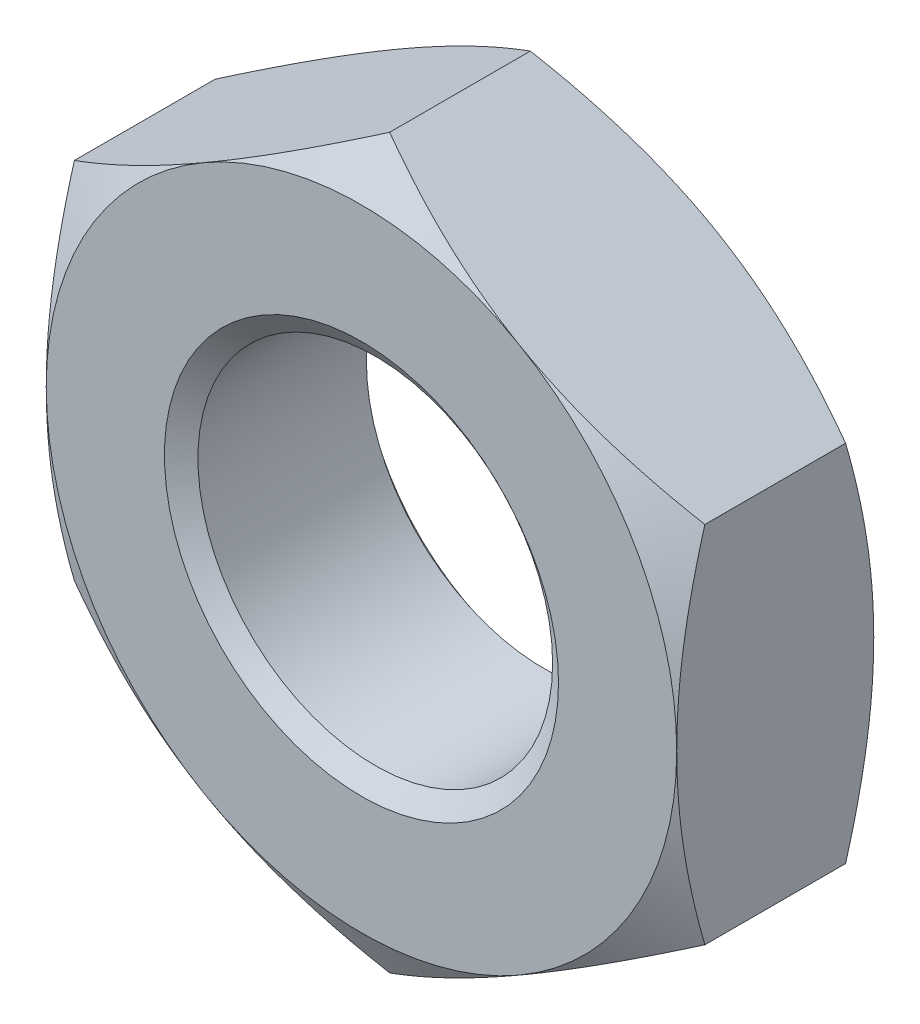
ISO-10303-21;
HEADER;
FILE_DESCRIPTION(('STEP AP214'),'2;1');
FILE_NAME('part.step','',(''),(''),'','','');
FILE_SCHEMA(('AUTOMOTIVE_DESIGN { 1 0 10303 214 1 1 1 1 }'));
ENDSEC;
DATA;
#1=APPLICATION_CONTEXT('core data for automotive mechanical design processes');
#2=APPLICATION_PROTOCOL_DEFINITION('international standard','automotive_design',2000,#1);
#3=PRODUCT_CONTEXT('',#1,'mechanical');
#4=PRODUCT('Part','Part','',(#3));
#5=PRODUCT_RELATED_PRODUCT_CATEGORY('part','',(#4));
#6=PRODUCT_DEFINITION_FORMATION('','',#4);
#7=PRODUCT_DEFINITION_CONTEXT('part definition',#1,'design');
#8=PRODUCT_DEFINITION('design','',#6,#7);
#9=PRODUCT_DEFINITION_SHAPE('','',#8);
#10=(LENGTH_UNIT() NAMED_UNIT(*) SI_UNIT(.MILLI.,.METRE.));
#11=(NAMED_UNIT(*) PLANE_ANGLE_UNIT() SI_UNIT($,.RADIAN.));
#12=(NAMED_UNIT(*) SI_UNIT($,.STERADIAN.) SOLID_ANGLE_UNIT());
#13=UNCERTAINTY_MEASURE_WITH_UNIT(LENGTH_MEASURE(1.E-05),#10,'distance_accuracy_value','');
#14=(GEOMETRIC_REPRESENTATION_CONTEXT(3) GLOBAL_UNCERTAINTY_ASSIGNED_CONTEXT((#13)) GLOBAL_UNIT_ASSIGNED_CONTEXT((#10,
#11,#12)) REPRESENTATION_CONTEXT('',''));
#15=CARTESIAN_POINT('',(0.,0.,0.));
#16=DIRECTION('',(0.,0.,1.));
#17=DIRECTION('',(1.,0.,0.));
#18=AXIS2_PLACEMENT_3D('',#15,#16,#17);
#19=CARTESIAN_POINT('',(0.,0.,-5.));
#20=DIRECTION('',(0.,0.,1.));
#21=DIRECTION('',(1.,0.,0.));
#22=AXIS2_PLACEMENT_3D('',#19,#20,#21);
#23=CYLINDRICAL_SURFACE('',#22,4.5);
#24=CARTESIAN_POINT('',(0.,0.,-0.350103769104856));
#25=DIRECTION('',(0.,0.,1.));
#26=DIRECTION('',(1.,0.,0.));
#27=AXIS2_PLACEMENT_3D('',#24,#25,#26);
#28=CIRCLE('',#27,4.5);
#29=CARTESIAN_POINT('',(4.5,0.,-0.350103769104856));
#30=VERTEX_POINT('',#29);
#31=EDGE_CURVE('E176',#30,#30,#28,.F.);
#32=ORIENTED_EDGE('',*,*,#31,.F.);
#33=EDGE_LOOP('',(#32));
#34=FACE_BOUND('',#33,.T.);
#35=CARTESIAN_POINT('',(0.,0.,-4.62449623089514));
#36=DIRECTION('',(0.,0.,-1.));
#37=DIRECTION('',(-1.,0.,0.));
#38=AXIS2_PLACEMENT_3D('',#35,#36,#37);
#39=CIRCLE('',#38,4.5);
#40=CARTESIAN_POINT('',(-4.5,0.,-4.62449623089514));
#41=VERTEX_POINT('',#40);
#42=EDGE_CURVE('E41',#41,#41,#39,.F.);
#43=ORIENTED_EDGE('',*,*,#42,.F.);
#44=EDGE_LOOP('',(#43));
#45=FACE_BOUND('',#44,.T.);
#46=ADVANCED_FACE('F36',(#34,#45),#23,.F.);
#47=CARTESIAN_POINT('',(0.,9.23760430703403,-5.));
#48=DIRECTION('',(-0.500000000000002,0.866025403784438,0.));
#49=DIRECTION('',(-0.866025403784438,-0.500000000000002,0.));
#50=AXIS2_PLACEMENT_3D('',#47,#48,#49);
#51=PLANE('',#50);
#52=DIRECTION('',(0.,0.,1.));
#53=VECTOR('',#52,1.);
#54=CARTESIAN_POINT('',(-8.,4.618802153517,-5.));
#55=LINE('',#54,#53);
#56=CARTESIAN_POINT('',(-8.,4.61880215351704,-4.28546882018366));
#57=VERTEX_POINT('',#56);
#58=CARTESIAN_POINT('',(-8.,4.618802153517,-0.714531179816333));
#59=VERTEX_POINT('',#58);
#60=EDGE_CURVE('E166',#57,#59,#55,.T.);
#61=ORIENTED_EDGE('',*,*,#60,.T.);
#62=CARTESIAN_POINT('',(-8.0002,4.61868668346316,-0.714597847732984));
#63=CARTESIAN_POINT('',(-7.8243512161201,4.72021302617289,-0.655990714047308));
#64=CARTESIAN_POINT('',(-7.64784680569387,4.82211789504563,-0.600043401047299));
#65=CARTESIAN_POINT('',(-7.29340453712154,5.02675523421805,-0.494201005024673));
#66=CARTESIAN_POINT('',(-7.11546609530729,5.12948804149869,-0.444308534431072));
#67=CARTESIAN_POINT('',(-6.57880176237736,5.43933133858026,-0.304692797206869));
#68=CARTESIAN_POINT('',(-6.21795741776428,5.64766491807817,-0.225281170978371));
#69=CARTESIAN_POINT('',(-5.67796082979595,5.95943209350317,-0.132161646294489));
#70=CARTESIAN_POINT('',(-5.50042181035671,6.06193429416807,-0.105634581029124));
#71=CARTESIAN_POINT('',(-5.1445408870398,6.26740224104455,-0.0611531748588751));
#72=CARTESIAN_POINT('',(-4.96619905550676,6.37036794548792,-0.0431980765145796));
#73=CARTESIAN_POINT('',(-4.6092083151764,6.57647664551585,-0.0163156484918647));
#74=CARTESIAN_POINT('',(-4.4305599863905,6.67961930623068,-0.00737807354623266));
#75=CARTESIAN_POINT('',(-4.07309829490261,6.88599991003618,0.00127769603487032));
#76=CARTESIAN_POINT('',(-3.89428493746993,6.98923785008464,0.00099617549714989));
#77=CARTESIAN_POINT('',(-3.55998663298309,7.18224506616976,-0.00814502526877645));
#78=CARTESIAN_POINT('',(-3.40447809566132,7.27202796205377,-0.0158896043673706));
#79=CARTESIAN_POINT('',(-3.09382523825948,7.45138347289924,-0.0382011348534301));
#80=CARTESIAN_POINT('',(-2.93868094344,7.54095607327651,-0.05276854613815));
#81=CARTESIAN_POINT('',(-2.47384868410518,7.80932710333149,-0.106360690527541));
#82=CARTESIAN_POINT('',(-2.16498351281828,7.98765049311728,-0.15526864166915));
#83=CARTESIAN_POINT('',(-1.5439767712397,8.34618890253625,-0.277539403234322));
#84=CARTESIAN_POINT('',(-1.23191445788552,8.52635816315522,-0.351420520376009));
#85=CARTESIAN_POINT('',(-0.612443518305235,8.88400987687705,-0.519100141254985));
#86=CARTESIAN_POINT('',(-0.305026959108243,9.06149691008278,-0.61285926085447));
#87=CARTESIAN_POINT('',(0.000200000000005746,9.23771977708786,-0.714597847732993));
#88=B_SPLINE_CURVE_WITH_KNOTS('',3,(#62,#63,#64,#65,#66,#67,#68,#69,#70,#71,#72,#73,#74,#75,#76,
#77,#78,#79,#80,#81,#82,#83,#84,#85,#86,#87),.UNSPECIFIED.,.F.,.F.,(4,2,2,2,2,2,2,2,2,2,2,2,4),
(0.,0.633973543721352,1.26821965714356,2.53934712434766,3.1593434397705,3.77928496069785,
4.39852133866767,5.01773858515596,5.5568023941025,6.09590254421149,7.17487077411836,
8.27776850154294,9.37850115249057),.UNSPECIFIED.);
#89=CARTESIAN_POINT('',(-4.00000000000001,6.9282032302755,0.));
#90=VERTEX_POINT('',#89);
#91=EDGE_CURVE('E135',#59,#90,#88,.T.);
#92=ORIENTED_EDGE('',*,*,#91,.T.);
#93=CARTESIAN_POINT('',(0.,9.23760430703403,-0.714531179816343));
#94=VERTEX_POINT('',#93);
#95=EDGE_CURVE('E55',#90,#94,#88,.T.);
#96=ORIENTED_EDGE('',*,*,#95,.T.);
#97=DIRECTION('',(0.,0.,1.));
#98=VECTOR('',#97,1.);
#99=CARTESIAN_POINT('',(0.,9.23760430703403,-5.));
#100=LINE('',#99,#98);
#101=CARTESIAN_POINT('',(0.,9.23760430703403,-4.28546882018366));
#102=VERTEX_POINT('',#101);
#103=EDGE_CURVE('E151',#102,#94,#100,.T.);
#104=ORIENTED_EDGE('',*,*,#103,.F.);
#105=CARTESIAN_POINT('',(-8.0002,4.61868668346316,-4.28540215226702));
#106=CARTESIAN_POINT('',(-7.8243512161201,4.72021302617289,-4.34400928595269));
#107=CARTESIAN_POINT('',(-7.64784680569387,4.82211789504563,-4.3999565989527));
#108=CARTESIAN_POINT('',(-7.29340453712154,5.02675523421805,-4.50579899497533));
#109=CARTESIAN_POINT('',(-7.11546609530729,5.12948804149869,-4.55569146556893));
#110=CARTESIAN_POINT('',(-6.57880176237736,5.43933133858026,-4.69530720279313));
#111=CARTESIAN_POINT('',(-6.21795741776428,5.64766491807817,-4.77471882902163));
#112=CARTESIAN_POINT('',(-5.67796082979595,5.95943209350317,-4.86783835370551));
#113=CARTESIAN_POINT('',(-5.50042181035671,6.06193429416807,-4.89436541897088));
#114=CARTESIAN_POINT('',(-5.1445408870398,6.26740224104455,-4.93884682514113));
#115=CARTESIAN_POINT('',(-4.96619905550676,6.37036794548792,-4.95680192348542));
#116=CARTESIAN_POINT('',(-4.6092083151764,6.57647664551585,-4.98368435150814));
#117=CARTESIAN_POINT('',(-4.4305599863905,6.67961930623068,-4.99262192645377));
#118=CARTESIAN_POINT('',(-4.07309829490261,6.88599991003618,-5.00127769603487));
#119=CARTESIAN_POINT('',(-3.89428493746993,6.98923785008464,-5.00099617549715));
#120=CARTESIAN_POINT('',(-3.55998663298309,7.18224506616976,-4.99185497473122));
#121=CARTESIAN_POINT('',(-3.40447809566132,7.27202796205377,-4.98411039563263));
#122=CARTESIAN_POINT('',(-3.09382523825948,7.45138347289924,-4.96179886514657));
#123=CARTESIAN_POINT('',(-2.93868094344,7.54095607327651,-4.94723145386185));
#124=CARTESIAN_POINT('',(-2.47384868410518,7.80932710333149,-4.89363930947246));
#125=CARTESIAN_POINT('',(-2.16498351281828,7.98765049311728,-4.84473135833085));
#126=CARTESIAN_POINT('',(-1.5439767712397,8.34618890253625,-4.72246059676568));
#127=CARTESIAN_POINT('',(-1.23191445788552,8.52635816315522,-4.64857947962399));
#128=CARTESIAN_POINT('',(-0.612443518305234,8.88400987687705,-4.48089985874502));
#129=CARTESIAN_POINT('',(-0.305026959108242,9.06149691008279,-4.38714073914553));
#130=CARTESIAN_POINT('',(0.000200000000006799,9.23771977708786,-4.28540215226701));
#131=B_SPLINE_CURVE_WITH_KNOTS('',3,(#105,#106,#107,#108,#109,#110,#111,#112,#113,#114,#115,
#116,#117,#118,#119,#120,#121,#122,#123,#124,#125,#126,#127,#128,#129,#130),.UNSPECIFIED.,.F.,
.F.,(4,2,2,2,2,2,2,2,2,2,2,2,4),(0.,0.633973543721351,1.26821965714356,2.53934712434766,
3.1593434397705,3.77928496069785,4.39852133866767,5.01773858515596,5.5568023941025,
6.09590254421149,7.17487077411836,8.27776850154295,9.37850115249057),.UNSPECIFIED.);
#132=CARTESIAN_POINT('',(-4.00000000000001,6.9282032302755,-5.));
#133=VERTEX_POINT('',#132);
#134=EDGE_CURVE('E169',#133,#102,#131,.T.);
#135=ORIENTED_EDGE('',*,*,#134,.F.);
#136=EDGE_CURVE('E268',#57,#133,#131,.T.);
#137=ORIENTED_EDGE('',*,*,#136,.F.);
#138=EDGE_LOOP('',(#61,#92,#96,#104,#135,#137));
#139=FACE_BOUND('',#138,.T.);
#140=ADVANCED_FACE('F38',(#139),#51,.T.);
#141=CARTESIAN_POINT('',(8.,4.61880215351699,-5.));
#142=DIRECTION('',(0.500000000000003,0.866025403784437,0.));
#143=DIRECTION('',(-0.866025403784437,0.500000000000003,0.));
#144=AXIS2_PLACEMENT_3D('',#141,#142,#143);
#145=PLANE('',#144);
#146=ORIENTED_EDGE('',*,*,#103,.T.);
#147=CARTESIAN_POINT('',(-0.000199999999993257,9.23771977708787,-0.714597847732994));
#148=CARTESIAN_POINT('',(0.175648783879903,9.13619343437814,-0.655990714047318));
#149=CARTESIAN_POINT('',(0.352153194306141,9.03428856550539,-0.600043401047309));
#150=CARTESIAN_POINT('',(0.706595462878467,8.82965122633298,-0.494201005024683));
#151=CARTESIAN_POINT('',(0.884533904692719,8.72691841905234,-0.444308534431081));
#152=CARTESIAN_POINT('',(1.42119823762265,8.41707512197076,-0.304692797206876));
#153=CARTESIAN_POINT('',(1.78204258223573,8.20874154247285,-0.225281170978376));
#154=CARTESIAN_POINT('',(2.32203917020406,7.89697436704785,-0.132161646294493));
#155=CARTESIAN_POINT('',(2.49957818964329,7.79447216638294,-0.105634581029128));
#156=CARTESIAN_POINT('',(2.85545911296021,7.58900421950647,-0.0611531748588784));
#157=CARTESIAN_POINT('',(3.03380094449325,7.4860385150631,-0.0431980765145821));
#158=CARTESIAN_POINT('',(3.3907916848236,7.27992981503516,-0.0163156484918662));
#159=CARTESIAN_POINT('',(3.56944001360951,7.17678715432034,-0.00737807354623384));
#160=CARTESIAN_POINT('',(3.92690170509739,6.97040655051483,0.0012776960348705));
#161=CARTESIAN_POINT('',(4.10571506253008,6.86716861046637,0.00099617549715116));
#162=CARTESIAN_POINT('',(4.44001336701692,6.67416139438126,-0.00814502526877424));
#163=CARTESIAN_POINT('',(4.59552190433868,6.58437849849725,-0.0158896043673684));
#164=CARTESIAN_POINT('',(4.90617476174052,6.40502298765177,-0.0382011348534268));
#165=CARTESIAN_POINT('',(5.06131905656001,6.3154503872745,-0.0527685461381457));
#166=CARTESIAN_POINT('',(5.52615131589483,6.04707935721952,-0.106360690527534));
#167=CARTESIAN_POINT('',(5.83501648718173,5.86875596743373,-0.155268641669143));
#168=CARTESIAN_POINT('',(6.4560232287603,5.51021755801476,-0.277539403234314));
#169=CARTESIAN_POINT('',(6.76808554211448,5.33004829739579,-0.351420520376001));
#170=CARTESIAN_POINT('',(7.38755648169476,4.97239658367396,-0.519100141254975));
#171=CARTESIAN_POINT('',(7.69497304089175,4.79490955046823,-0.612859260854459));
#172=CARTESIAN_POINT('',(8.0002,4.61868668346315,-0.714597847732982));
#173=B_SPLINE_CURVE_WITH_KNOTS('',3,(#147,#148,#149,#150,#151,#152,#153,#154,#155,#156,#157,
#158,#159,#160,#161,#162,#163,#164,#165,#166,#167,#168,#169,#170,#171,#172),.UNSPECIFIED.,.F.,
.F.,(4,2,2,2,2,2,2,2,2,2,2,2,4),(0.,0.633973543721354,1.26821965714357,2.53934712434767,
3.1593434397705,3.77928496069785,4.39852133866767,5.01773858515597,5.55680239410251,
6.09590254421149,7.17487077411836,8.27776850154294,9.37850115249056),.UNSPECIFIED.);
#174=CARTESIAN_POINT('',(4.00000000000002,6.9282032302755,0.));
#175=VERTEX_POINT('',#174);
#176=EDGE_CURVE('E145',#94,#175,#173,.T.);
#177=ORIENTED_EDGE('',*,*,#176,.T.);
#178=CARTESIAN_POINT('',(8.,4.61880215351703,-0.714531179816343));
#179=VERTEX_POINT('',#178);
#180=EDGE_CURVE('E62',#175,#179,#173,.T.);
#181=ORIENTED_EDGE('',*,*,#180,.T.);
#182=DIRECTION('',(0.,0.,1.));
#183=VECTOR('',#182,1.);
#184=CARTESIAN_POINT('',(8.,4.61880215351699,-5.));
#185=LINE('',#184,#183);
#186=CARTESIAN_POINT('',(8.,4.61880215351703,-4.28546882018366));
#187=VERTEX_POINT('',#186);
#188=EDGE_CURVE('E144',#187,#179,#185,.T.);
#189=ORIENTED_EDGE('',*,*,#188,.F.);
#190=CARTESIAN_POINT('',(-0.000199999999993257,9.23771977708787,-4.28540215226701));
#191=CARTESIAN_POINT('',(0.175648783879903,9.13619343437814,-4.34400928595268));
#192=CARTESIAN_POINT('',(0.352153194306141,9.03428856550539,-4.39995659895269));
#193=CARTESIAN_POINT('',(0.706595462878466,8.82965122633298,-4.50579899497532));
#194=CARTESIAN_POINT('',(0.884533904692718,8.72691841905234,-4.55569146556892));
#195=CARTESIAN_POINT('',(1.42119823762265,8.41707512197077,-4.69530720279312));
#196=CARTESIAN_POINT('',(1.78204258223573,8.20874154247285,-4.77471882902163));
#197=CARTESIAN_POINT('',(2.32203917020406,7.89697436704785,-4.86783835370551));
#198=CARTESIAN_POINT('',(2.49957818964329,7.79447216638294,-4.89436541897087));
#199=CARTESIAN_POINT('',(2.85545911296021,7.58900421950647,-4.93884682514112));
#200=CARTESIAN_POINT('',(3.03380094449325,7.4860385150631,-4.95680192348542));
#201=CARTESIAN_POINT('',(3.3907916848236,7.27992981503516,-4.98368435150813));
#202=CARTESIAN_POINT('',(3.56944001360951,7.17678715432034,-4.99262192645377));
#203=CARTESIAN_POINT('',(3.9269017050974,6.97040655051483,-5.00127769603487));
#204=CARTESIAN_POINT('',(4.10571506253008,6.86716861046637,-5.00099617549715));
#205=CARTESIAN_POINT('',(4.44001336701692,6.67416139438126,-4.99185497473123));
#206=CARTESIAN_POINT('',(4.59552190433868,6.58437849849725,-4.98411039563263));
#207=CARTESIAN_POINT('',(4.90617476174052,6.40502298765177,-4.96179886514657));
#208=CARTESIAN_POINT('',(5.06131905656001,6.3154503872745,-4.94723145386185));
#209=CARTESIAN_POINT('',(5.52615131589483,6.04707935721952,-4.89363930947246));
#210=CARTESIAN_POINT('',(5.83501648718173,5.86875596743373,-4.84473135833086));
#211=CARTESIAN_POINT('',(6.45602322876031,5.51021755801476,-4.72246059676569));
#212=CARTESIAN_POINT('',(6.76808554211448,5.33004829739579,-4.648579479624));
#213=CARTESIAN_POINT('',(7.38755648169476,4.97239658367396,-4.48089985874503));
#214=CARTESIAN_POINT('',(7.69497304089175,4.79490955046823,-4.38714073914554));
#215=CARTESIAN_POINT('',(8.0002,4.61868668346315,-4.28540215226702));
#216=B_SPLINE_CURVE_WITH_KNOTS('',3,(#190,#191,#192,#193,#194,#195,#196,#197,#198,#199,#200,
#201,#202,#203,#204,#205,#206,#207,#208,#209,#210,#211,#212,#213,#214,#215),.UNSPECIFIED.,.F.,
.F.,(4,2,2,2,2,2,2,2,2,2,2,2,4),(0.,0.633973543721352,1.26821965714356,2.53934712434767,
3.1593434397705,3.77928496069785,4.39852133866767,5.01773858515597,5.5568023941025,
6.0959025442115,7.17487077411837,8.27776850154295,9.37850115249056),.UNSPECIFIED.);
#217=CARTESIAN_POINT('',(4.00000000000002,6.9282032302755,-5.));
#218=VERTEX_POINT('',#217);
#219=EDGE_CURVE('E261',#218,#187,#216,.T.);
#220=ORIENTED_EDGE('',*,*,#219,.F.);
#221=EDGE_CURVE('E267',#102,#218,#216,.T.);
#222=ORIENTED_EDGE('',*,*,#221,.F.);
#223=EDGE_LOOP('',(#146,#177,#181,#189,#220,#222));
#224=FACE_BOUND('',#223,.T.);
#225=ADVANCED_FACE('F142',(#224),#145,.T.);
#226=CARTESIAN_POINT('',(8.,4.61880215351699,-5.));
#227=DIRECTION('',(-1.,0.,0.));
#228=DIRECTION('',(0.,0.,1.));
#229=AXIS2_PLACEMENT_3D('',#226,#227,#228);
#230=PLANE('',#229);
#231=CARTESIAN_POINT('',(8.,-12.2497439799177,-3.82821364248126));
#232=CARTESIAN_POINT('',(8.,-11.8984987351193,-3.6584725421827));
#233=CARTESIAN_POINT('',(8.,-11.5464230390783,-3.49041880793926));
#234=CARTESIAN_POINT('',(8.,-10.8401616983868,-3.15865029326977));
#235=CARTESIAN_POINT('',(8.,-10.4859757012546,-2.99493626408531));
#236=CARTESIAN_POINT('',(8.,-9.77313142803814,-2.67194892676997));
#237=CARTESIAN_POINT('',(8.,-9.41445915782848,-2.51270639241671));
#238=CARTESIAN_POINT('',(8.,-8.69416671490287,-2.20106116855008));
#239=CARTESIAN_POINT('',(8.,-8.33254669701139,-2.04865812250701));
#240=CARTESIAN_POINT('',(8.,-7.60129405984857,-1.75070130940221));
#241=CARTESIAN_POINT('',(8.,-7.23161757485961,-1.60525460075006));
#242=CARTESIAN_POINT('',(8.,-6.4879052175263,-1.32575242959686));
#243=CARTESIAN_POINT('',(8.,-6.11386886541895,-1.19169823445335));
#244=CARTESIAN_POINT('',(8.,-5.36160531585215,-0.938583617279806));
#245=CARTESIAN_POINT('',(8.,-4.98338896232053,-0.819491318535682));
#246=CARTESIAN_POINT('',(8.,-4.2215930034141,-0.600166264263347));
#247=CARTESIAN_POINT('',(8.,-3.83801513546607,-0.499927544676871));
#248=CARTESIAN_POINT('',(8.,-3.06517005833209,-0.323183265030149));
#249=CARTESIAN_POINT('',(8.,-2.67590136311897,-0.246684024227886));
#250=CARTESIAN_POINT('',(8.,-2.08857290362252,-0.153570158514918));
#251=CARTESIAN_POINT('',(8.,-1.89220175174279,-0.126136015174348));
#252=CARTESIAN_POINT('',(8.,-1.49853877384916,-0.0790191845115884));
#253=CARTESIAN_POINT('',(8.,-1.3012470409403,-0.0593357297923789));
#254=CARTESIAN_POINT('',(8.,-0.907261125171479,-0.0282499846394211));
#255=CARTESIAN_POINT('',(8.,-0.710571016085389,-0.0167962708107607));
#256=CARTESIAN_POINT('',(8.,-0.316882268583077,-0.00223056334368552));
#257=CARTESIAN_POINT('',(8.,-0.11988363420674,0.000881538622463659));
#258=CARTESIAN_POINT('',(8.,0.274012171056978,-0.0013101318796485));
#259=CARTESIAN_POINT('',(8.,0.470909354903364,-0.00661154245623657));
#260=CARTESIAN_POINT('',(8.,0.864308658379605,-0.0254984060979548));
#261=CARTESIAN_POINT('',(8.,1.06081075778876,-0.0390842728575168));
#262=CARTESIAN_POINT('',(8.,1.53707134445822,-0.0817685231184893));
#263=CARTESIAN_POINT('',(8.,1.81646391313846,-0.115017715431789));
#264=CARTESIAN_POINT('',(8.,2.37310809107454,-0.196418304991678));
#265=CARTESIAN_POINT('',(8.,2.65035909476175,-0.244573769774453));
#266=CARTESIAN_POINT('',(8.,3.20249141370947,-0.354078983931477));
#267=CARTESIAN_POINT('',(8.,3.47737023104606,-0.415441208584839));
#268=CARTESIAN_POINT('',(8.,4.02429975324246,-0.549487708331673));
#269=CARTESIAN_POINT('',(8.,4.29635072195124,-0.622170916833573));
#270=CARTESIAN_POINT('',(8.,4.84432510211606,-0.779020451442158));
#271=CARTESIAN_POINT('',(8.,5.12017997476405,-0.86342458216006));
#272=CARTESIAN_POINT('',(8.,5.66897392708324,-1.04057245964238));
#273=CARTESIAN_POINT('',(8.,5.94191487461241,-1.13331045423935));
#274=CARTESIAN_POINT('',(8.,6.4837857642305,-1.32521046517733));
#275=CARTESIAN_POINT('',(8.,6.75272963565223,-1.42433338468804));
#276=CARTESIAN_POINT('',(8.,7.28853074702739,-1.628397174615));
#277=CARTESIAN_POINT('',(8.,7.5553870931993,-1.73334039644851));
#278=CARTESIAN_POINT('',(8.,7.82127397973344,-1.84061801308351));
#279=B_SPLINE_CURVE_WITH_KNOTS('',3,(#231,#232,#233,#234,#235,#236,#237,#238,#239,#240,#241,
#242,#243,#244,#245,#246,#247,#248,#249,#250,#251,#252,#253,#254,#255,#256,#257,#258,#259,#260,
#261,#262,#263,#264,#265,#266,#267,#268,#269,#270,#271,#272,#273,#274,#275,#276,#277,#278),
.UNSPECIFIED.,.F.,.F.,(4,2,2,2,2,2,2,2,2,2,2,2,2,2,2,2,2,2,2,2,2,2,2,4),(0.,1.17034358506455,
2.3408884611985,3.51813189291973,4.69531388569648,5.88694801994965,7.07871454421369,
8.26789729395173,9.4567032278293,10.6458253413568,11.2405311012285,11.8351779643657,
12.4260760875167,13.0169665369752,13.6076911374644,14.1984452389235,15.0420672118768,
15.8859195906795,16.7305726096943,17.5751460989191,18.4404219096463,19.3051050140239,
20.1649211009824,21.0250871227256),.UNSPECIFIED.);
#280=CARTESIAN_POINT('',(7.99999999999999,-4.61880215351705,-0.714531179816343));
#281=VERTEX_POINT('',#280);
#282=CARTESIAN_POINT('',(8.,0.,0.));
#283=VERTEX_POINT('',#282);
#284=EDGE_CURVE('E137',#281,#283,#279,.T.);
#285=ORIENTED_EDGE('',*,*,#284,.F.);
#286=DIRECTION('',(0.,0.,1.));
#287=VECTOR('',#286,1.);
#288=CARTESIAN_POINT('',(8.,-4.61880215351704,-5.));
#289=LINE('',#288,#287);
#290=CARTESIAN_POINT('',(7.99999999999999,-4.61880215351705,-4.28546882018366));
#291=VERTEX_POINT('',#290);
#292=EDGE_CURVE('E152',#291,#281,#289,.T.);
#293=ORIENTED_EDGE('',*,*,#292,.F.);
#294=CARTESIAN_POINT('',(8.,-12.2497439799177,-1.17178635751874));
#295=CARTESIAN_POINT('',(8.,-11.8984987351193,-1.3415274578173));
#296=CARTESIAN_POINT('',(8.,-11.5464230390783,-1.50958119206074));
#297=CARTESIAN_POINT('',(8.,-10.8401616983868,-1.84134970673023));
#298=CARTESIAN_POINT('',(8.,-10.4859757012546,-2.00506373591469));
#299=CARTESIAN_POINT('',(8.,-9.77313142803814,-2.32805107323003));
#300=CARTESIAN_POINT('',(8.,-9.41445915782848,-2.48729360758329));
#301=CARTESIAN_POINT('',(8.,-8.69416671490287,-2.79893883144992));
#302=CARTESIAN_POINT('',(8.,-8.33254669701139,-2.95134187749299));
#303=CARTESIAN_POINT('',(8.,-7.60129405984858,-3.24929869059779));
#304=CARTESIAN_POINT('',(8.,-7.23161757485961,-3.39474539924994));
#305=CARTESIAN_POINT('',(8.,-6.4879052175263,-3.67424757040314));
#306=CARTESIAN_POINT('',(8.,-6.11386886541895,-3.80830176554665));
#307=CARTESIAN_POINT('',(8.,-5.36160531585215,-4.06141638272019));
#308=CARTESIAN_POINT('',(8.,-4.98338896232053,-4.18050868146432));
#309=CARTESIAN_POINT('',(8.,-4.2215930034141,-4.39983373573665));
#310=CARTESIAN_POINT('',(8.,-3.83801513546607,-4.50007245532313));
#311=CARTESIAN_POINT('',(8.,-3.06517005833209,-4.67681673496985));
#312=CARTESIAN_POINT('',(8.,-2.67590136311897,-4.75331597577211));
#313=CARTESIAN_POINT('',(8.,-2.08857290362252,-4.84642984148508));
#314=CARTESIAN_POINT('',(8.,-1.89220175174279,-4.87386398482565));
#315=CARTESIAN_POINT('',(8.,-1.49853877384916,-4.92098081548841));
#316=CARTESIAN_POINT('',(8.,-1.3012470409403,-4.94066427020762));
#317=CARTESIAN_POINT('',(8.,-0.907261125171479,-4.97175001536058));
#318=CARTESIAN_POINT('',(8.,-0.710571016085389,-4.98320372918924));
#319=CARTESIAN_POINT('',(8.,-0.316882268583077,-4.99776943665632));
#320=CARTESIAN_POINT('',(8.,-0.11988363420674,-5.00088153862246));
#321=CARTESIAN_POINT('',(8.,0.274012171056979,-4.99868986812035));
#322=CARTESIAN_POINT('',(8.,0.470909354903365,-4.99338845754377));
#323=CARTESIAN_POINT('',(8.,0.864308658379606,-4.97450159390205));
#324=CARTESIAN_POINT('',(8.,1.06081075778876,-4.96091572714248));
#325=CARTESIAN_POINT('',(8.,1.53707134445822,-4.91823147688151));
#326=CARTESIAN_POINT('',(8.,1.81646391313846,-4.88498228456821));
#327=CARTESIAN_POINT('',(8.,2.37310809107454,-4.80358169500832));
#328=CARTESIAN_POINT('',(8.,2.65035909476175,-4.75542623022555));
#329=CARTESIAN_POINT('',(8.,3.20249141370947,-4.64592101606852));
#330=CARTESIAN_POINT('',(8.,3.47737023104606,-4.58455879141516));
#331=CARTESIAN_POINT('',(8.,4.02429975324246,-4.45051229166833));
#332=CARTESIAN_POINT('',(8.,4.29635072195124,-4.37782908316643));
#333=CARTESIAN_POINT('',(8.,4.84432510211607,-4.22097954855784));
#334=CARTESIAN_POINT('',(8.,5.12017997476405,-4.13657541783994));
#335=CARTESIAN_POINT('',(8.,5.66897392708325,-3.95942754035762));
#336=CARTESIAN_POINT('',(8.,5.94191487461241,-3.86668954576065));
#337=CARTESIAN_POINT('',(8.,6.4837857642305,-3.67478953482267));
#338=CARTESIAN_POINT('',(8.,6.75272963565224,-3.57566661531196));
#339=CARTESIAN_POINT('',(8.,7.28853074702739,-3.37160282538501));
#340=CARTESIAN_POINT('',(8.,7.5553870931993,-3.26665960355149));
#341=CARTESIAN_POINT('',(8.,7.82127397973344,-3.15938198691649));
#342=B_SPLINE_CURVE_WITH_KNOTS('',3,(#294,#295,#296,#297,#298,#299,#300,#301,#302,#303,#304,
#305,#306,#307,#308,#309,#310,#311,#312,#313,#314,#315,#316,#317,#318,#319,#320,#321,#322,#323,
#324,#325,#326,#327,#328,#329,#330,#331,#332,#333,#334,#335,#336,#337,#338,#339,#340,#341),
.UNSPECIFIED.,.F.,.F.,(4,2,2,2,2,2,2,2,2,2,2,2,2,2,2,2,2,2,2,2,2,2,2,4),(0.,1.17034358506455,
2.3408884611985,3.51813189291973,4.69531388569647,5.88694801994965,7.07871454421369,
8.26789729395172,9.4567032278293,10.6458253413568,11.2405311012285,11.8351779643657,
12.4260760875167,13.0169665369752,13.6076911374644,14.1984452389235,15.0420672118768,
15.8859195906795,16.7305726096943,17.5751460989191,18.4404219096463,19.3051050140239,
20.1649211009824,21.0250871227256),.UNSPECIFIED.);
#343=CARTESIAN_POINT('',(8.,0.,-5.));
#344=VERTEX_POINT('',#343);
#345=EDGE_CURVE('E275',#291,#344,#342,.T.);
#346=ORIENTED_EDGE('',*,*,#345,.T.);
#347=EDGE_CURVE('E150',#344,#187,#342,.T.);
#348=ORIENTED_EDGE('',*,*,#347,.T.);
#349=ORIENTED_EDGE('',*,*,#188,.T.);
#350=EDGE_CURVE('E127',#283,#179,#279,.T.);
#351=ORIENTED_EDGE('',*,*,#350,.F.);
#352=EDGE_LOOP('',(#285,#293,#346,#348,#349,#351));
#353=FACE_BOUND('',#352,.T.);
#354=ADVANCED_FACE('F148',(#353),#230,.F.);
#355=CARTESIAN_POINT('',(0.,-9.23760430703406,-5.));
#356=DIRECTION('',(0.500000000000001,-0.866025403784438,0.));
#357=DIRECTION('',(0.866025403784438,0.500000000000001,0.));
#358=AXIS2_PLACEMENT_3D('',#355,#356,#357);
#359=PLANE('',#358);
#360=ORIENTED_EDGE('',*,*,#292,.T.);
#361=CARTESIAN_POINT('',(8.0002,-4.6186866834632,-0.714597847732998));
#362=CARTESIAN_POINT('',(7.82435121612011,-4.72021302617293,-0.655990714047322));
#363=CARTESIAN_POINT('',(7.64784680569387,-4.82211789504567,-0.600043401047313));
#364=CARTESIAN_POINT('',(7.29340453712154,-5.02675523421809,-0.494201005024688));
#365=CARTESIAN_POINT('',(7.11546609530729,-5.12948804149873,-0.444308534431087));
#366=CARTESIAN_POINT('',(6.57880176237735,-5.4393313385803,-0.304692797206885));
#367=CARTESIAN_POINT('',(6.21795741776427,-5.64766491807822,-0.225281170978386));
#368=CARTESIAN_POINT('',(5.67796082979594,-5.95943209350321,-0.132161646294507));
#369=CARTESIAN_POINT('',(5.50042181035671,-6.06193429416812,-0.105634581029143));
#370=CARTESIAN_POINT('',(5.14454088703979,-6.26740224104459,-0.0611531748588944));
#371=CARTESIAN_POINT('',(4.96619905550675,-6.37036794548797,-0.0431980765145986));
#372=CARTESIAN_POINT('',(4.60920831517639,-6.5764766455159,-0.0163156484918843));
#373=CARTESIAN_POINT('',(4.43055998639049,-6.67961930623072,-0.00737807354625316));
#374=CARTESIAN_POINT('',(4.0730982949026,-6.88599991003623,0.00127769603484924));
#375=CARTESIAN_POINT('',(3.89428493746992,-6.98923785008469,0.000996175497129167));
#376=CARTESIAN_POINT('',(3.55998663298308,-7.1822450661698,-0.00814502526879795));
#377=CARTESIAN_POINT('',(3.40447809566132,-7.27202796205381,-0.015889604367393));
#378=CARTESIAN_POINT('',(3.09382523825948,-7.45138347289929,-0.0382011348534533));
#379=CARTESIAN_POINT('',(2.93868094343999,-7.54095607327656,-0.052768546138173));
#380=CARTESIAN_POINT('',(2.47384868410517,-7.80932710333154,-0.106360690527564));
#381=CARTESIAN_POINT('',(2.16498351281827,-7.98765049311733,-0.155268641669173));
#382=CARTESIAN_POINT('',(1.5439767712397,-8.34618890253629,-0.277539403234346));
#383=CARTESIAN_POINT('',(1.23191445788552,-8.52635816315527,-0.351420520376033));
#384=CARTESIAN_POINT('',(0.612443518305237,-8.88400987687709,-0.519100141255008));
#385=CARTESIAN_POINT('',(0.305026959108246,-9.06149691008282,-0.612859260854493));
#386=CARTESIAN_POINT('',(-0.000200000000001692,-9.2377197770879,-0.714597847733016));
#387=B_SPLINE_CURVE_WITH_KNOTS('',3,(#361,#362,#363,#364,#365,#366,#367,#368,#369,#370,#371,
#372,#373,#374,#375,#376,#377,#378,#379,#380,#381,#382,#383,#384,#385,#386),.UNSPECIFIED.,.F.,
.F.,(4,2,2,2,2,2,2,2,2,2,2,2,4),(0.,0.633973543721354,1.26821965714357,2.53934712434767,
3.15934343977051,3.77928496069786,4.39852133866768,5.01773858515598,5.55680239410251,
6.0959025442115,7.17487077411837,8.27776850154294,9.37850115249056),.UNSPECIFIED.);
#388=CARTESIAN_POINT('',(4.00000000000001,-6.9282032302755,0.));
#389=VERTEX_POINT('',#388);
#390=EDGE_CURVE('E373',#281,#389,#387,.T.);
#391=ORIENTED_EDGE('',*,*,#390,.T.);
#392=CARTESIAN_POINT('',(0.,-9.23760430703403,-0.714531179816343));
#393=VERTEX_POINT('',#392);
#394=EDGE_CURVE('E229',#389,#393,#387,.T.);
#395=ORIENTED_EDGE('',*,*,#394,.T.);
#396=DIRECTION('',(0.,0.,1.));
#397=VECTOR('',#396,1.);
#398=CARTESIAN_POINT('',(0.,-9.23760430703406,-5.));
#399=LINE('',#398,#397);
#400=CARTESIAN_POINT('',(0.,-9.23760430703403,-4.28546882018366));
#401=VERTEX_POINT('',#400);
#402=EDGE_CURVE('E157',#401,#393,#399,.T.);
#403=ORIENTED_EDGE('',*,*,#402,.F.);
#404=CARTESIAN_POINT('',(8.0002,-4.6186866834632,-4.285402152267));
#405=CARTESIAN_POINT('',(7.82435121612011,-4.72021302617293,-4.34400928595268));
#406=CARTESIAN_POINT('',(7.64784680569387,-4.82211789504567,-4.39995659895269));
#407=CARTESIAN_POINT('',(7.29340453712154,-5.02675523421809,-4.50579899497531));
#408=CARTESIAN_POINT('',(7.11546609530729,-5.12948804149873,-4.55569146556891));
#409=CARTESIAN_POINT('',(6.57880176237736,-5.4393313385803,-4.69530720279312));
#410=CARTESIAN_POINT('',(6.21795741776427,-5.64766491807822,-4.77471882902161));
#411=CARTESIAN_POINT('',(5.67796082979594,-5.95943209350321,-4.86783835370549));
#412=CARTESIAN_POINT('',(5.50042181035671,-6.06193429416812,-4.89436541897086));
#413=CARTESIAN_POINT('',(5.14454088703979,-6.26740224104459,-4.93884682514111));
#414=CARTESIAN_POINT('',(4.96619905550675,-6.37036794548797,-4.9568019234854));
#415=CARTESIAN_POINT('',(4.60920831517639,-6.5764766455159,-4.98368435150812));
#416=CARTESIAN_POINT('',(4.43055998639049,-6.67961930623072,-4.99262192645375));
#417=CARTESIAN_POINT('',(4.0730982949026,-6.88599991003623,-5.00127769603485));
#418=CARTESIAN_POINT('',(3.89428493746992,-6.98923785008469,-5.00099617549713));
#419=CARTESIAN_POINT('',(3.55998663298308,-7.1822450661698,-4.9918549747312));
#420=CARTESIAN_POINT('',(3.40447809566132,-7.27202796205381,-4.98411039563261));
#421=CARTESIAN_POINT('',(3.09382523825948,-7.45138347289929,-4.96179886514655));
#422=CARTESIAN_POINT('',(2.93868094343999,-7.54095607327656,-4.94723145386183));
#423=CARTESIAN_POINT('',(2.47384868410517,-7.80932710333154,-4.89363930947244));
#424=CARTESIAN_POINT('',(2.16498351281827,-7.98765049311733,-4.84473135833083));
#425=CARTESIAN_POINT('',(1.5439767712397,-8.34618890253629,-4.72246059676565));
#426=CARTESIAN_POINT('',(1.23191445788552,-8.52635816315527,-4.64857947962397));
#427=CARTESIAN_POINT('',(0.612443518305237,-8.88400987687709,-4.48089985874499));
#428=CARTESIAN_POINT('',(0.305026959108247,-9.06149691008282,-4.38714073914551));
#429=CARTESIAN_POINT('',(-0.000200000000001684,-9.2377197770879,-4.28540215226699));
#430=B_SPLINE_CURVE_WITH_KNOTS('',3,(#404,#405,#406,#407,#408,#409,#410,#411,#412,#413,#414,
#415,#416,#417,#418,#419,#420,#421,#422,#423,#424,#425,#426,#427,#428,#429),.UNSPECIFIED.,.F.,
.F.,(4,2,2,2,2,2,2,2,2,2,2,2,4),(0.,0.633973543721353,1.26821965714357,2.53934712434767,
3.15934343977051,3.77928496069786,4.39852133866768,5.01773858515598,5.55680239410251,
6.0959025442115,7.17487077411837,8.27776850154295,9.37850115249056),.UNSPECIFIED.);
#431=CARTESIAN_POINT('',(4.00000000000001,-6.9282032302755,-5.));
#432=VERTEX_POINT('',#431);
#433=EDGE_CURVE('E282',#432,#401,#430,.T.);
#434=ORIENTED_EDGE('',*,*,#433,.F.);
#435=EDGE_CURVE('E281',#291,#432,#430,.T.);
#436=ORIENTED_EDGE('',*,*,#435,.F.);
#437=EDGE_LOOP('',(#360,#391,#395,#403,#434,#436));
#438=FACE_BOUND('',#437,.T.);
#439=ADVANCED_FACE('F294',(#438),#359,.T.);
#440=CARTESIAN_POINT('',(-8.,-4.61880215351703,-5.));
#441=DIRECTION('',(-0.500000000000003,-0.866025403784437,0.));
#442=DIRECTION('',(0.866025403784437,-0.500000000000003,0.));
#443=AXIS2_PLACEMENT_3D('',#440,#441,#442);
#444=PLANE('',#443);
#445=ORIENTED_EDGE('',*,*,#402,.T.);
#446=CARTESIAN_POINT('',(0.00019999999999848,-9.23771977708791,-0.714597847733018));
#447=CARTESIAN_POINT('',(-0.175648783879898,-9.13619343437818,-0.655990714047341));
#448=CARTESIAN_POINT('',(-0.352153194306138,-9.03428856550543,-0.600043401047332));
#449=CARTESIAN_POINT('',(-0.706595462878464,-8.82965122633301,-0.494201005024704));
#450=CARTESIAN_POINT('',(-0.884533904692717,-8.72691841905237,-0.444308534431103));
#451=CARTESIAN_POINT('',(-1.42119823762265,-8.4170751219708,-0.304692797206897));
#452=CARTESIAN_POINT('',(-1.78204258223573,-8.20874154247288,-0.225281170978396));
#453=CARTESIAN_POINT('',(-2.32203917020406,-7.89697436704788,-0.132161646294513));
#454=CARTESIAN_POINT('',(-2.4995781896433,-7.79447216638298,-0.105634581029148));
#455=CARTESIAN_POINT('',(-2.85545911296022,-7.5890042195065,-0.0611531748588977));
#456=CARTESIAN_POINT('',(-3.03380094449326,-7.48603851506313,-0.0431980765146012));
#457=CARTESIAN_POINT('',(-3.39079168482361,-7.27992981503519,-0.0163156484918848));
#458=CARTESIAN_POINT('',(-3.56944001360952,-7.17678715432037,-0.00737807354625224));
#459=CARTESIAN_POINT('',(-3.92690170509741,-6.97040655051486,0.00127769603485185));
#460=CARTESIAN_POINT('',(-4.10571506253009,-6.8671686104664,0.000996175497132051));
#461=CARTESIAN_POINT('',(-4.44001336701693,-6.67416139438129,-0.00814502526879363));
#462=CARTESIAN_POINT('',(-4.5955219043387,-6.58437849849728,-0.0158896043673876));
#463=CARTESIAN_POINT('',(-4.90617476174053,-6.4050229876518,-0.0382011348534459));
#464=CARTESIAN_POINT('',(-5.06131905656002,-6.31545038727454,-0.052768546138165));
#465=CARTESIAN_POINT('',(-5.52615131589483,-6.04707935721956,-0.106360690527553));
#466=CARTESIAN_POINT('',(-5.83501648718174,-5.86875596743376,-0.15526864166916));
#467=CARTESIAN_POINT('',(-6.45602322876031,-5.5102175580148,-0.277539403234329));
#468=CARTESIAN_POINT('',(-6.76808554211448,-5.33004829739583,-0.351420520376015));
#469=CARTESIAN_POINT('',(-7.38755648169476,-4.972396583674,-0.519100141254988));
#470=CARTESIAN_POINT('',(-7.69497304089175,-4.79490955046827,-0.612859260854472));
#471=CARTESIAN_POINT('',(-8.0002,-4.61868668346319,-0.714597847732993));
#472=B_SPLINE_CURVE_WITH_KNOTS('',3,(#446,#447,#448,#449,#450,#451,#452,#453,#454,#455,#456,
#457,#458,#459,#460,#461,#462,#463,#464,#465,#466,#467,#468,#469,#470,#471),.UNSPECIFIED.,.F.,
.F.,(4,2,2,2,2,2,2,2,2,2,2,2,4),(0.,0.633973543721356,1.26821965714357,2.53934712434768,
3.15934343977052,3.77928496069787,4.39852133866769,5.01773858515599,5.55680239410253,
6.09590254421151,7.17487077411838,8.27776850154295,9.37850115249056),.UNSPECIFIED.);
#473=CARTESIAN_POINT('',(-4.00000000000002,-6.9282032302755,0.));
#474=VERTEX_POINT('',#473);
#475=EDGE_CURVE('E370',#393,#474,#472,.T.);
#476=ORIENTED_EDGE('',*,*,#475,.T.);
#477=CARTESIAN_POINT('',(-8.,-4.61880215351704,-0.714531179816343));
#478=VERTEX_POINT('',#477);
#479=EDGE_CURVE('E202',#474,#478,#472,.T.);
#480=ORIENTED_EDGE('',*,*,#479,.T.);
#481=DIRECTION('',(0.,0.,1.));
#482=VECTOR('',#481,1.);
#483=CARTESIAN_POINT('',(-8.,-4.61880215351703,-5.));
#484=LINE('',#483,#482);
#485=CARTESIAN_POINT('',(-8.,-4.61880215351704,-4.28546882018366));
#486=VERTEX_POINT('',#485);
#487=EDGE_CURVE('E163',#486,#478,#484,.T.);
#488=ORIENTED_EDGE('',*,*,#487,.F.);
#489=CARTESIAN_POINT('',(0.00019999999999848,-9.23771977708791,-4.28540215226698));
#490=CARTESIAN_POINT('',(-0.175648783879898,-9.13619343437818,-4.34400928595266));
#491=CARTESIAN_POINT('',(-0.352153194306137,-9.03428856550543,-4.39995659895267));
#492=CARTESIAN_POINT('',(-0.706595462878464,-8.82965122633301,-4.5057989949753));
#493=CARTESIAN_POINT('',(-0.884533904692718,-8.72691841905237,-4.5556914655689));
#494=CARTESIAN_POINT('',(-1.42119823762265,-8.4170751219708,-4.6953072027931));
#495=CARTESIAN_POINT('',(-1.78204258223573,-8.20874154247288,-4.77471882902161));
#496=CARTESIAN_POINT('',(-2.32203917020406,-7.89697436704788,-4.86783835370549));
#497=CARTESIAN_POINT('',(-2.4995781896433,-7.79447216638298,-4.89436541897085));
#498=CARTESIAN_POINT('',(-2.85545911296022,-7.5890042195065,-4.9388468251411));
#499=CARTESIAN_POINT('',(-3.03380094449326,-7.48603851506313,-4.9568019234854));
#500=CARTESIAN_POINT('',(-3.39079168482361,-7.27992981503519,-4.98368435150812));
#501=CARTESIAN_POINT('',(-3.56944001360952,-7.17678715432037,-4.99262192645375));
#502=CARTESIAN_POINT('',(-3.92690170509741,-6.97040655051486,-5.00127769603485));
#503=CARTESIAN_POINT('',(-4.10571506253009,-6.8671686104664,-5.00099617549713));
#504=CARTESIAN_POINT('',(-4.44001336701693,-6.67416139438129,-4.99185497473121));
#505=CARTESIAN_POINT('',(-4.5955219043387,-6.58437849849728,-4.98411039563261));
#506=CARTESIAN_POINT('',(-4.90617476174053,-6.4050229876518,-4.96179886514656));
#507=CARTESIAN_POINT('',(-5.06131905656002,-6.31545038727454,-4.94723145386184));
#508=CARTESIAN_POINT('',(-5.52615131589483,-6.04707935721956,-4.89363930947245));
#509=CARTESIAN_POINT('',(-5.83501648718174,-5.86875596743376,-4.84473135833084));
#510=CARTESIAN_POINT('',(-6.45602322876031,-5.5102175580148,-4.72246059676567));
#511=CARTESIAN_POINT('',(-6.76808554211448,-5.33004829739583,-4.64857947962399));
#512=CARTESIAN_POINT('',(-7.38755648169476,-4.972396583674,-4.48089985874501));
#513=CARTESIAN_POINT('',(-7.69497304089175,-4.79490955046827,-4.38714073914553));
#514=CARTESIAN_POINT('',(-8.0002,-4.61868668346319,-4.28540215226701));
#515=B_SPLINE_CURVE_WITH_KNOTS('',3,(#489,#490,#491,#492,#493,#494,#495,#496,#497,#498,#499,
#500,#501,#502,#503,#504,#505,#506,#507,#508,#509,#510,#511,#512,#513,#514),.UNSPECIFIED.,.F.,
.F.,(4,2,2,2,2,2,2,2,2,2,2,2,4),(0.,0.633973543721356,1.26821965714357,2.53934712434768,
3.15934343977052,3.77928496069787,4.39852133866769,5.01773858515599,5.55680239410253,
6.09590254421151,7.17487077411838,8.27776850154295,9.37850115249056),.UNSPECIFIED.);
#516=CARTESIAN_POINT('',(-4.00000000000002,-6.9282032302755,-5.));
#517=VERTEX_POINT('',#516);
#518=EDGE_CURVE('E289',#517,#486,#515,.T.);
#519=ORIENTED_EDGE('',*,*,#518,.F.);
#520=EDGE_CURVE('E288',#401,#517,#515,.T.);
#521=ORIENTED_EDGE('',*,*,#520,.F.);
#522=EDGE_LOOP('',(#445,#476,#480,#488,#519,#521));
#523=FACE_BOUND('',#522,.T.);
#524=ADVANCED_FACE('F297',(#523),#444,.T.);
#525=CARTESIAN_POINT('',(-8.,4.618802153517,-5.));
#526=DIRECTION('',(-1.,0.,0.));
#527=DIRECTION('',(0.,0.,1.));
#528=AXIS2_PLACEMENT_3D('',#525,#526,#527);
#529=PLANE('',#528);
#530=ORIENTED_EDGE('',*,*,#487,.T.);
#531=CARTESIAN_POINT('',(-8.,-12.2497439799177,-3.82821364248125));
#532=CARTESIAN_POINT('',(-8.,-11.8984987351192,-3.65847254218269));
#533=CARTESIAN_POINT('',(-8.,-11.5464230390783,-3.49041880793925));
#534=CARTESIAN_POINT('',(-8.,-10.8401616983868,-3.15865029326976));
#535=CARTESIAN_POINT('',(-8.,-10.4859757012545,-2.9949362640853));
#536=CARTESIAN_POINT('',(-8.,-9.77313142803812,-2.67194892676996));
#537=CARTESIAN_POINT('',(-8.,-9.41445915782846,-2.5127063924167));
#538=CARTESIAN_POINT('',(-8.,-8.69416671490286,-2.20106116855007));
#539=CARTESIAN_POINT('',(-8.,-8.33254669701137,-2.048658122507));
#540=CARTESIAN_POINT('',(-8.,-7.60129405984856,-1.75070130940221));
#541=CARTESIAN_POINT('',(-8.,-7.23161757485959,-1.60525460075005));
#542=CARTESIAN_POINT('',(-8.,-6.48790521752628,-1.32575242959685));
#543=CARTESIAN_POINT('',(-8.,-6.11386886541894,-1.19169823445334));
#544=CARTESIAN_POINT('',(-8.,-5.36160531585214,-0.938583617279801));
#545=CARTESIAN_POINT('',(-8.,-4.98338896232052,-0.819491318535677));
#546=CARTESIAN_POINT('',(-8.,-4.22159300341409,-0.600166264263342));
#547=CARTESIAN_POINT('',(-8.,-3.83801513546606,-0.499927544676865));
#548=CARTESIAN_POINT('',(-8.,-3.06517005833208,-0.323183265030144));
#549=CARTESIAN_POINT('',(-8.,-2.67590136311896,-0.246684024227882));
#550=CARTESIAN_POINT('',(-8.,-2.08857290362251,-0.153570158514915));
#551=CARTESIAN_POINT('',(-8.,-1.89220175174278,-0.126136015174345));
#552=CARTESIAN_POINT('',(-8.,-1.49853877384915,-0.0790191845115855));
#553=CARTESIAN_POINT('',(-8.,-1.30124704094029,-0.059335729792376));
#554=CARTESIAN_POINT('',(-8.,-0.907261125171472,-0.0282499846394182));
#555=CARTESIAN_POINT('',(-8.,-0.710571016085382,-0.0167962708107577));
#556=CARTESIAN_POINT('',(-8.,-0.316882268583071,-0.00223056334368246));
#557=CARTESIAN_POINT('',(-8.,-0.119883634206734,0.000881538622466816));
#558=CARTESIAN_POINT('',(-8.,0.274012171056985,-0.00131013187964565));
#559=CARTESIAN_POINT('',(-8.,0.470909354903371,-0.00661154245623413));
#560=CARTESIAN_POINT('',(-8.,0.864308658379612,-0.0254984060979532));
#561=CARTESIAN_POINT('',(-8.,1.06081075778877,-0.0390842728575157));
#562=CARTESIAN_POINT('',(-8.,1.53707134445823,-0.0817685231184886));
#563=CARTESIAN_POINT('',(-8.,1.81646391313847,-0.115017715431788));
#564=CARTESIAN_POINT('',(-8.,2.37310809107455,-0.196418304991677));
#565=CARTESIAN_POINT('',(-8.,2.65035909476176,-0.244573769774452));
#566=CARTESIAN_POINT('',(-8.,3.20249141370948,-0.354078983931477));
#567=CARTESIAN_POINT('',(-8.,3.47737023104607,-0.415441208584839));
#568=CARTESIAN_POINT('',(-8.,4.02429975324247,-0.549487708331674));
#569=CARTESIAN_POINT('',(-8.,4.29635072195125,-0.622170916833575));
#570=CARTESIAN_POINT('',(-8.,4.84432510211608,-0.77902045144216));
#571=CARTESIAN_POINT('',(-8.,5.12017997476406,-0.863424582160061));
#572=CARTESIAN_POINT('',(-8.,5.66897392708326,-1.04057245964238));
#573=CARTESIAN_POINT('',(-8.,5.94191487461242,-1.13331045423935));
#574=CARTESIAN_POINT('',(-8.,6.48378576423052,-1.32521046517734));
#575=CARTESIAN_POINT('',(-8.,6.75272963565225,-1.42433338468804));
#576=CARTESIAN_POINT('',(-8.,7.2885307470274,-1.628397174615));
#577=CARTESIAN_POINT('',(-8.,7.55538709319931,-1.73334039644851));
#578=CARTESIAN_POINT('',(-8.,7.82127397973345,-1.84061801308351));
#579=B_SPLINE_CURVE_WITH_KNOTS('',3,(#531,#532,#533,#534,#535,#536,#537,#538,#539,#540,#541,
#542,#543,#544,#545,#546,#547,#548,#549,#550,#551,#552,#553,#554,#555,#556,#557,#558,#559,#560,
#561,#562,#563,#564,#565,#566,#567,#568,#569,#570,#571,#572,#573,#574,#575,#576,#577,#578),
.UNSPECIFIED.,.F.,.F.,(4,2,2,2,2,2,2,2,2,2,2,2,2,2,2,2,2,2,2,2,2,2,2,4),(0.,1.17034358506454,
2.34088846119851,3.51813189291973,4.69531388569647,5.88694801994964,7.07871454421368,
8.26789729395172,9.45670322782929,10.6458253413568,11.2405311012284,11.8351779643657,
12.4260760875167,13.0169665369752,13.6076911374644,14.1984452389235,15.0420672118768,
15.8859195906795,16.7305726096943,17.5751460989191,18.4404219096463,19.3051050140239,
20.1649211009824,21.0250871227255),.UNSPECIFIED.);
#580=CARTESIAN_POINT('',(-8.,0.,0.));
#581=VERTEX_POINT('',#580);
#582=EDGE_CURVE('E201',#478,#581,#579,.T.);
#583=ORIENTED_EDGE('',*,*,#582,.T.);
#584=EDGE_CURVE('E193',#581,#59,#579,.T.);
#585=ORIENTED_EDGE('',*,*,#584,.T.);
#586=ORIENTED_EDGE('',*,*,#60,.F.);
#587=CARTESIAN_POINT('',(-8.,-12.2497439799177,-1.17178635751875));
#588=CARTESIAN_POINT('',(-8.,-11.8984987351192,-1.34152745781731));
#589=CARTESIAN_POINT('',(-8.,-11.5464230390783,-1.50958119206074));
#590=CARTESIAN_POINT('',(-8.,-10.8401616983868,-1.84134970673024));
#591=CARTESIAN_POINT('',(-8.,-10.4859757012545,-2.0050637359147));
#592=CARTESIAN_POINT('',(-8.,-9.77313142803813,-2.32805107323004));
#593=CARTESIAN_POINT('',(-8.,-9.41445915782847,-2.4872936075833));
#594=CARTESIAN_POINT('',(-8.,-8.69416671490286,-2.79893883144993));
#595=CARTESIAN_POINT('',(-8.,-8.33254669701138,-2.951341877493));
#596=CARTESIAN_POINT('',(-8.,-7.60129405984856,-3.24929869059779));
#597=CARTESIAN_POINT('',(-8.,-7.23161757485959,-3.39474539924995));
#598=CARTESIAN_POINT('',(-8.,-6.48790521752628,-3.67424757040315));
#599=CARTESIAN_POINT('',(-8.,-6.11386886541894,-3.80830176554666));
#600=CARTESIAN_POINT('',(-8.,-5.36160531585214,-4.0614163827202));
#601=CARTESIAN_POINT('',(-8.,-4.98338896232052,-4.18050868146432));
#602=CARTESIAN_POINT('',(-8.,-4.22159300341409,-4.39983373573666));
#603=CARTESIAN_POINT('',(-8.,-3.83801513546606,-4.50007245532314));
#604=CARTESIAN_POINT('',(-8.,-3.06517005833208,-4.67681673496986));
#605=CARTESIAN_POINT('',(-8.,-2.67590136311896,-4.75331597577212));
#606=CARTESIAN_POINT('',(-8.,-2.08857290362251,-4.84642984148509));
#607=CARTESIAN_POINT('',(-8.,-1.89220175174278,-4.87386398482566));
#608=CARTESIAN_POINT('',(-8.,-1.49853877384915,-4.92098081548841));
#609=CARTESIAN_POINT('',(-8.,-1.30124704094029,-4.94066427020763));
#610=CARTESIAN_POINT('',(-8.,-0.907261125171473,-4.97175001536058));
#611=CARTESIAN_POINT('',(-8.,-0.710571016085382,-4.98320372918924));
#612=CARTESIAN_POINT('',(-8.,-0.31688226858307,-4.99776943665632));
#613=CARTESIAN_POINT('',(-8.,-0.119883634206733,-5.00088153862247));
#614=CARTESIAN_POINT('',(-8.,0.274012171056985,-4.99868986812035));
#615=CARTESIAN_POINT('',(-8.,0.470909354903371,-4.99338845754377));
#616=CARTESIAN_POINT('',(-8.,0.864308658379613,-4.97450159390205));
#617=CARTESIAN_POINT('',(-8.,1.06081075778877,-4.96091572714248));
#618=CARTESIAN_POINT('',(-8.,1.53707134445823,-4.91823147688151));
#619=CARTESIAN_POINT('',(-8.,1.81646391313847,-4.88498228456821));
#620=CARTESIAN_POINT('',(-8.,2.37310809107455,-4.80358169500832));
#621=CARTESIAN_POINT('',(-8.,2.65035909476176,-4.75542623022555));
#622=CARTESIAN_POINT('',(-8.,3.20249141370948,-4.64592101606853));
#623=CARTESIAN_POINT('',(-8.,3.47737023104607,-4.58455879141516));
#624=CARTESIAN_POINT('',(-8.,4.02429975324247,-4.45051229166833));
#625=CARTESIAN_POINT('',(-8.,4.29635072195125,-4.37782908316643));
#626=CARTESIAN_POINT('',(-8.,4.84432510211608,-4.22097954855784));
#627=CARTESIAN_POINT('',(-8.,5.12017997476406,-4.13657541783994));
#628=CARTESIAN_POINT('',(-8.,5.66897392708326,-3.95942754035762));
#629=CARTESIAN_POINT('',(-8.,5.94191487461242,-3.86668954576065));
#630=CARTESIAN_POINT('',(-8.,6.48378576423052,-3.67478953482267));
#631=CARTESIAN_POINT('',(-8.,6.75272963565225,-3.57566661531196));
#632=CARTESIAN_POINT('',(-8.,7.2885307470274,-3.371602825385));
#633=CARTESIAN_POINT('',(-8.,7.55538709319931,-3.26665960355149));
#634=CARTESIAN_POINT('',(-8.,7.82127397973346,-3.15938198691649));
#635=B_SPLINE_CURVE_WITH_KNOTS('',3,(#587,#588,#589,#590,#591,#592,#593,#594,#595,#596,#597,
#598,#599,#600,#601,#602,#603,#604,#605,#606,#607,#608,#609,#610,#611,#612,#613,#614,#615,#616,
#617,#618,#619,#620,#621,#622,#623,#624,#625,#626,#627,#628,#629,#630,#631,#632,#633,#634),
.UNSPECIFIED.,.F.,.F.,(4,2,2,2,2,2,2,2,2,2,2,2,2,2,2,2,2,2,2,2,2,2,2,4),(0.,1.17034358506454,
2.3408884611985,3.51813189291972,4.69531388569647,5.88694801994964,7.07871454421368,
8.26789729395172,9.4567032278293,10.6458253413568,11.2405311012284,11.8351779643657,
12.4260760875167,13.0169665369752,13.6076911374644,14.1984452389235,15.0420672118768,
15.8859195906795,16.7305726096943,17.5751460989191,18.4404219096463,19.3051050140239,
20.1649211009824,21.0250871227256),.UNSPECIFIED.);
#636=CARTESIAN_POINT('',(-8.,0.,-5.));
#637=VERTEX_POINT('',#636);
#638=EDGE_CURVE('E341',#637,#57,#635,.T.);
#639=ORIENTED_EDGE('',*,*,#638,.F.);
#640=EDGE_CURVE('E344',#486,#637,#635,.T.);
#641=ORIENTED_EDGE('',*,*,#640,.F.);
#642=EDGE_LOOP('',(#530,#583,#585,#586,#639,#641));
#643=FACE_BOUND('',#642,.T.);
#644=ADVANCED_FACE('F209',(#643),#529,.T.);
#645=CARTESIAN_POINT('',(0.,9.23760430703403,0.));
#646=DIRECTION('',(0.,0.,-1.));
#647=DIRECTION('',(-1.,0.,0.));
#648=AXIS2_PLACEMENT_3D('',#645,#646,#647);
#649=PLANE('',#648);
#650=CARTESIAN_POINT('',(0.,0.,0.));
#651=DIRECTION('',(0.,0.,1.));
#652=DIRECTION('',(1.,0.,0.));
#653=AXIS2_PLACEMENT_3D('',#650,#651,#652);
#654=CIRCLE('',#653,5.);
#655=CARTESIAN_POINT('',(5.,0.,0.));
#656=VERTEX_POINT('',#655);
#657=EDGE_CURVE('E178',#656,#656,#654,.T.);
#658=ORIENTED_EDGE('',*,*,#657,.F.);
#659=EDGE_LOOP('',(#658));
#660=FACE_BOUND('',#659,.T.);
#661=CARTESIAN_POINT('',(0.,0.,0.));
#662=DIRECTION('',(0.,0.,-1.));
#663=DIRECTION('',(-1.,0.,0.));
#664=AXIS2_PLACEMENT_3D('',#661,#662,#663);
#665=CIRCLE('',#664,8.);
#666=EDGE_CURVE('E11',#581,#90,#665,.T.);
#667=ORIENTED_EDGE('',*,*,#666,.F.);
#668=EDGE_CURVE('E48',#474,#581,#665,.T.);
#669=ORIENTED_EDGE('',*,*,#668,.F.);
#670=EDGE_CURVE('E175',#389,#474,#665,.T.);
#671=ORIENTED_EDGE('',*,*,#670,.F.);
#672=EDGE_CURVE('E377',#283,#389,#665,.T.);
#673=ORIENTED_EDGE('',*,*,#672,.F.);
#674=CARTESIAN_POINT('',(0.,0.,0.));
#675=DIRECTION('',(0.,0.,1.));
#676=DIRECTION('',(1.,0.,0.));
#677=AXIS2_PLACEMENT_3D('',#674,#675,#676);
#678=CIRCLE('',#677,8.);
#679=EDGE_CURVE('E130',#283,#175,#678,.T.);
#680=ORIENTED_EDGE('',*,*,#679,.T.);
#681=EDGE_CURVE('E46',#90,#175,#665,.T.);
#682=ORIENTED_EDGE('',*,*,#681,.F.);
#683=EDGE_LOOP('',(#667,#669,#671,#673,#680,#682));
#684=FACE_BOUND('',#683,.T.);
#685=ADVANCED_FACE('F257',(#660,#684),#649,.F.);
#686=CARTESIAN_POINT('',(0.,9.23760430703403,-5.));
#687=DIRECTION('',(0.,0.,-1.));
#688=DIRECTION('',(-1.,0.,0.));
#689=AXIS2_PLACEMENT_3D('',#686,#687,#688);
#690=PLANE('',#689);
#691=CARTESIAN_POINT('',(0.,0.,-5.));
#692=DIRECTION('',(0.,0.,-1.));
#693=DIRECTION('',(-1.,0.,0.));
#694=AXIS2_PLACEMENT_3D('',#691,#692,#693);
#695=CIRCLE('',#694,5.);
#696=CARTESIAN_POINT('',(-5.,0.,-5.));
#697=VERTEX_POINT('',#696);
#698=EDGE_CURVE('E179',#697,#697,#695,.F.);
#699=ORIENTED_EDGE('',*,*,#698,.T.);
#700=EDGE_LOOP('',(#699));
#701=FACE_BOUND('',#700,.T.);
#702=CARTESIAN_POINT('',(0.,0.,-5.));
#703=DIRECTION('',(0.,0.,-1.));
#704=DIRECTION('',(-1.,0.,0.));
#705=AXIS2_PLACEMENT_3D('',#702,#703,#704);
#706=CIRCLE('',#705,8.);
#707=EDGE_CURVE('E172',#637,#517,#706,.F.);
#708=ORIENTED_EDGE('',*,*,#707,.F.);
#709=EDGE_CURVE('E154',#133,#637,#706,.F.);
#710=ORIENTED_EDGE('',*,*,#709,.F.);
#711=EDGE_CURVE('E171',#218,#133,#706,.F.);
#712=ORIENTED_EDGE('',*,*,#711,.F.);
#713=CARTESIAN_POINT('',(0.,0.,-5.));
#714=DIRECTION('',(0.,0.,1.));
#715=DIRECTION('',(1.,0.,0.));
#716=AXIS2_PLACEMENT_3D('',#713,#714,#715);
#717=CIRCLE('',#716,8.);
#718=EDGE_CURVE('E252',#344,#218,#717,.T.);
#719=ORIENTED_EDGE('',*,*,#718,.F.);
#720=EDGE_CURVE('E357',#432,#344,#706,.F.);
#721=ORIENTED_EDGE('',*,*,#720,.F.);
#722=EDGE_CURVE('E336',#517,#432,#706,.F.);
#723=ORIENTED_EDGE('',*,*,#722,.F.);
#724=EDGE_LOOP('',(#708,#710,#712,#719,#721,#723));
#725=FACE_BOUND('',#724,.T.);
#726=ADVANCED_FACE('F316',(#701,#725),#690,.T.);
#727=CARTESIAN_POINT('',(0.,0.,-5.));
#728=DIRECTION('',(0.,0.,1.));
#729=DIRECTION('',(1.,0.,0.));
#730=AXIS2_PLACEMENT_3D('',#727,#728,#729);
#731=CONICAL_SURFACE('',#730,8.,1.04719755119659);
#732=ORIENTED_EDGE('',*,*,#136,.T.);
#733=ORIENTED_EDGE('',*,*,#709,.T.);
#734=ORIENTED_EDGE('',*,*,#638,.T.);
#735=EDGE_LOOP('',(#732,#733,#734));
#736=FACE_BOUND('',#735,.T.);
#737=ADVANCED_FACE('F318',(#736),#731,.T.);
#738=ORIENTED_EDGE('',*,*,#134,.T.);
#739=ORIENTED_EDGE('',*,*,#221,.T.);
#740=ORIENTED_EDGE('',*,*,#711,.T.);
#741=EDGE_LOOP('',(#738,#739,#740));
#742=FACE_BOUND('',#741,.T.);
#743=ADVANCED_FACE('F323',(#742),#731,.T.);
#744=ORIENTED_EDGE('',*,*,#219,.T.);
#745=ORIENTED_EDGE('',*,*,#347,.F.);
#746=ORIENTED_EDGE('',*,*,#718,.T.);
#747=EDGE_LOOP('',(#744,#745,#746));
#748=FACE_BOUND('',#747,.T.);
#749=ADVANCED_FACE('F380',(#748),#731,.T.);
#750=ORIENTED_EDGE('',*,*,#435,.T.);
#751=ORIENTED_EDGE('',*,*,#720,.T.);
#752=ORIENTED_EDGE('',*,*,#345,.F.);
#753=EDGE_LOOP('',(#750,#751,#752));
#754=FACE_BOUND('',#753,.T.);
#755=ADVANCED_FACE('F326',(#754),#731,.T.);
#756=ORIENTED_EDGE('',*,*,#433,.T.);
#757=ORIENTED_EDGE('',*,*,#520,.T.);
#758=ORIENTED_EDGE('',*,*,#722,.T.);
#759=EDGE_LOOP('',(#756,#757,#758));
#760=FACE_BOUND('',#759,.T.);
#761=ADVANCED_FACE('F325',(#760),#731,.T.);
#762=ORIENTED_EDGE('',*,*,#518,.T.);
#763=ORIENTED_EDGE('',*,*,#640,.T.);
#764=ORIENTED_EDGE('',*,*,#707,.T.);
#765=EDGE_LOOP('',(#762,#763,#764));
#766=FACE_BOUND('',#765,.T.);
#767=ADVANCED_FACE('F217',(#766),#731,.T.);
#768=CARTESIAN_POINT('',(0.,0.,0.));
#769=DIRECTION('',(0.,0.,-1.));
#770=DIRECTION('',(-1.,0.,0.));
#771=AXIS2_PLACEMENT_3D('',#768,#769,#770);
#772=CONICAL_SURFACE('',#771,8.,1.04719755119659);
#773=ORIENTED_EDGE('',*,*,#668,.T.);
#774=ORIENTED_EDGE('',*,*,#582,.F.);
#775=ORIENTED_EDGE('',*,*,#479,.F.);
#776=EDGE_LOOP('',(#773,#774,#775));
#777=FACE_BOUND('',#776,.T.);
#778=ADVANCED_FACE('F211',(#777),#772,.T.);
#779=ORIENTED_EDGE('',*,*,#670,.T.);
#780=ORIENTED_EDGE('',*,*,#475,.F.);
#781=ORIENTED_EDGE('',*,*,#394,.F.);
#782=EDGE_LOOP('',(#779,#780,#781));
#783=FACE_BOUND('',#782,.T.);
#784=ADVANCED_FACE('F216',(#783),#772,.T.);
#785=ORIENTED_EDGE('',*,*,#284,.T.);
#786=ORIENTED_EDGE('',*,*,#672,.T.);
#787=ORIENTED_EDGE('',*,*,#390,.F.);
#788=EDGE_LOOP('',(#785,#786,#787));
#789=FACE_BOUND('',#788,.T.);
#790=ADVANCED_FACE('F376',(#789),#772,.T.);
#791=ORIENTED_EDGE('',*,*,#679,.F.);
#792=ORIENTED_EDGE('',*,*,#350,.T.);
#793=ORIENTED_EDGE('',*,*,#180,.F.);
#794=EDGE_LOOP('',(#791,#792,#793));
#795=FACE_BOUND('',#794,.T.);
#796=ADVANCED_FACE('F128',(#795),#772,.T.);
#797=ORIENTED_EDGE('',*,*,#681,.T.);
#798=ORIENTED_EDGE('',*,*,#176,.F.);
#799=ORIENTED_EDGE('',*,*,#95,.F.);
#800=EDGE_LOOP('',(#797,#798,#799));
#801=FACE_BOUND('',#800,.T.);
#802=ADVANCED_FACE('F219',(#801),#772,.T.);
#803=ORIENTED_EDGE('',*,*,#584,.F.);
#804=ORIENTED_EDGE('',*,*,#666,.T.);
#805=ORIENTED_EDGE('',*,*,#91,.F.);
#806=EDGE_LOOP('',(#803,#804,#805));
#807=FACE_BOUND('',#806,.T.);
#808=ADVANCED_FACE('F406',(#807),#772,.T.);
#809=CARTESIAN_POINT('',(0.,0.,-0.385114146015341));
#810=DIRECTION('',(0.,0.,1.));
#811=DIRECTION('',(1.,0.,0.));
#812=AXIS2_PLACEMENT_3D('',#809,#810,#811);
#813=CONICAL_SURFACE('',#812,4.45,0.959931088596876);
#814=ORIENTED_EDGE('',*,*,#657,.T.);
#815=EDGE_LOOP('',(#814));
#816=FACE_BOUND('',#815,.T.);
#817=ORIENTED_EDGE('',*,*,#31,.T.);
#818=EDGE_LOOP('',(#817));
#819=FACE_BOUND('',#818,.T.);
#820=ADVANCED_FACE('F220',(#816,#819),#813,.F.);
#821=CARTESIAN_POINT('',(0.,0.,-4.9746));
#822=DIRECTION('',(0.,0.,-1.));
#823=DIRECTION('',(-1.,0.,0.));
#824=AXIS2_PLACEMENT_3D('',#821,#822,#823);
#825=CONICAL_SURFACE('',#824,5.,0.959931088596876);
#826=CARTESIAN_POINT('',(0.,0.,-4.9746));
#827=DIRECTION('',(0.,0.,1.));
#828=DIRECTION('',(1.,0.,0.));
#829=AXIS2_PLACEMENT_3D('',#826,#827,#828);
#830=CIRCLE('',#829,5.);
#831=CARTESIAN_POINT('',(5.,0.,-4.9746));
#832=VERTEX_POINT('',#831);
#833=EDGE_CURVE('E181',#832,#832,#830,.T.);
#834=ORIENTED_EDGE('',*,*,#833,.F.);
#835=EDGE_LOOP('',(#834));
#836=FACE_BOUND('',#835,.T.);
#837=ORIENTED_EDGE('',*,*,#42,.T.);
#838=EDGE_LOOP('',(#837));
#839=FACE_BOUND('',#838,.T.);
#840=ADVANCED_FACE('F434',(#836,#839),#825,.F.);
#841=CARTESIAN_POINT('',(0.,0.,-25.0375057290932));
#842=DIRECTION('',(0.,0.,1.));
#843=DIRECTION('',(1.,0.,0.));
#844=AXIS2_PLACEMENT_3D('',#841,#842,#843);
#845=CYLINDRICAL_SURFACE('',#844,5.);
#846=ORIENTED_EDGE('',*,*,#698,.F.);
#847=EDGE_LOOP('',(#846));
#848=FACE_BOUND('',#847,.T.);
#849=ORIENTED_EDGE('',*,*,#833,.T.);
#850=EDGE_LOOP('',(#849));
#851=FACE_BOUND('',#850,.T.);
#852=ADVANCED_FACE('F441',(#848,#851),#845,.F.);
#853=CLOSED_SHELL('',(#46,#140,#225,#354,#439,#524,#644,#685,#726,#737,#743,#749,#755,#761,#767,
#778,#784,#790,#796,#802,#808,#820,#840,#852));
#854=MANIFOLD_SOLID_BREP('B2',#853);
#855=ADVANCED_BREP_SHAPE_REPRESENTATION('',(#18,#854),#14);
#856=SHAPE_DEFINITION_REPRESENTATION(#9,#855);
ENDSEC;
END-ISO-10303-21;
